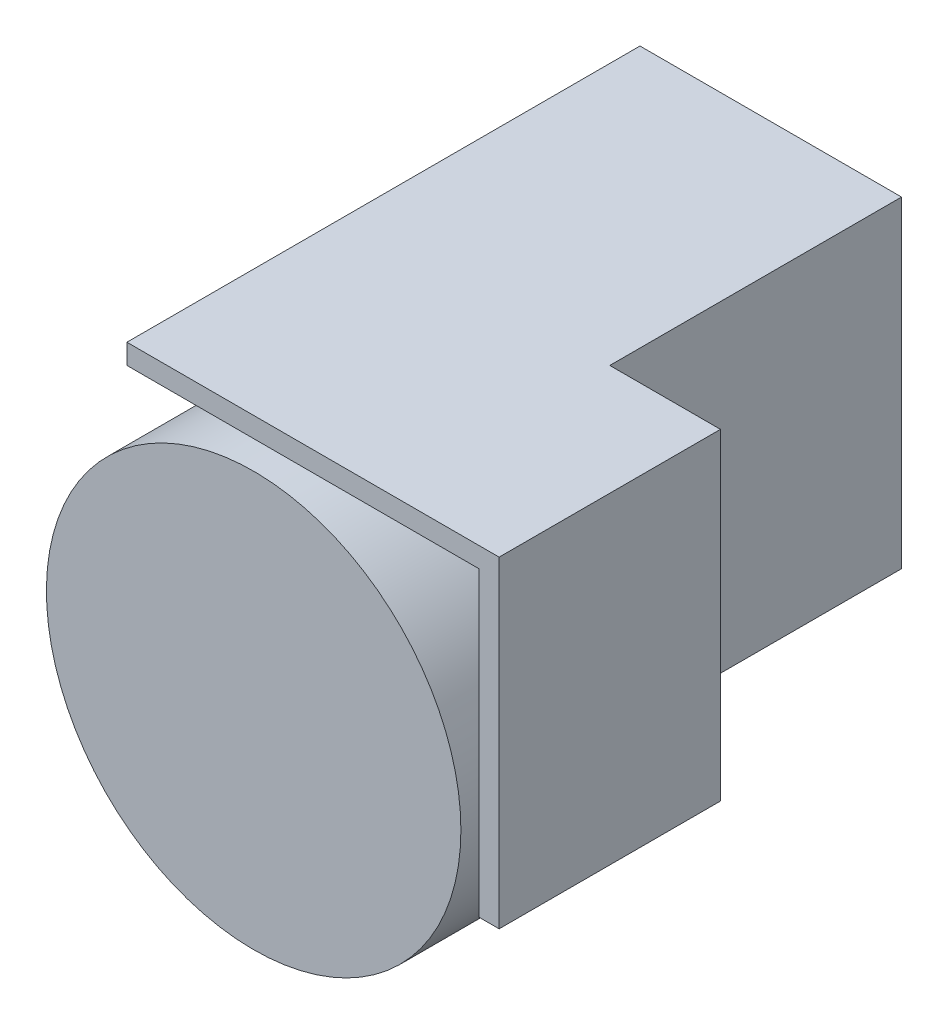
from build123d import *

# Parameters (mm, degrees)
SKIZZE1_W                       = 26
SKIZZE1_H                       = 30
AUFSATZ_LINEAR_AUSTRAGEN2_DEPTH = 30
AUFSATZ_LINEAR_AUSTRAGEN3_DEPTH = 51
SKIZZE2_R                       = 20.6
AUFSATZ_LINEAR_AUSTRAGEN4_DEPTH = 21.4
SKIZZE3_W                       = 11
SKIZZE3_H                       = 29
SCHNITT_LINEAR_AUSTRAGEN1_DEPTH = 74.43443232


with BuildPart() as part:
    # Skizze1 → Aufsatz-Linear austragen2 (new body)
    with BuildSketch(Plane.XY):
        with Locations((1.909377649, 15)):
            Rectangle(SKIZZE1_W, SKIZZE1_H)
    extrude(amount=AUFSATZ_LINEAR_AUSTRAGEN2_DEPTH)

    # Skizze1_4 → Aufsatz-Linear austragen3 (add)
    with BuildSketch(Plane.XY):
        Polygon((-11.090622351, 30), (23.909377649, 30), (23.909377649, 0), (25.909377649, 0), (25.909377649, 32), (23.909377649, 32), (-11.090622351, 32), align=None)
    extrude(amount=AUFSATZ_LINEAR_AUSTRAGEN3_DEPTH)

    # Skizze2 → Aufsatz-Linear austragen4 (add)
    with BuildSketch(Plane.XY.offset(30)):
        with Locations(Location((1.909377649, 7, 0), (0, 0, 129.128958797))):
            Circle(SKIZZE2_R)
    extrude(amount=AUFSATZ_LINEAR_AUSTRAGEN4_DEPTH)

    # Skizze3 → Schnitt-Linear austragen1 (cut, through all)
    with BuildSketch(Plane(origin=(0, 32, 0), x_dir=(1, 0, 0), z_dir=(0, 1, 0))):
        with Locations((20.409377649, -14.5)):
            Rectangle(SKIZZE3_W, SKIZZE3_H)
    extrude(amount=-SCHNITT_LINEAR_AUSTRAGEN1_DEPTH, mode=Mode.SUBTRACT)


solid = part.part
